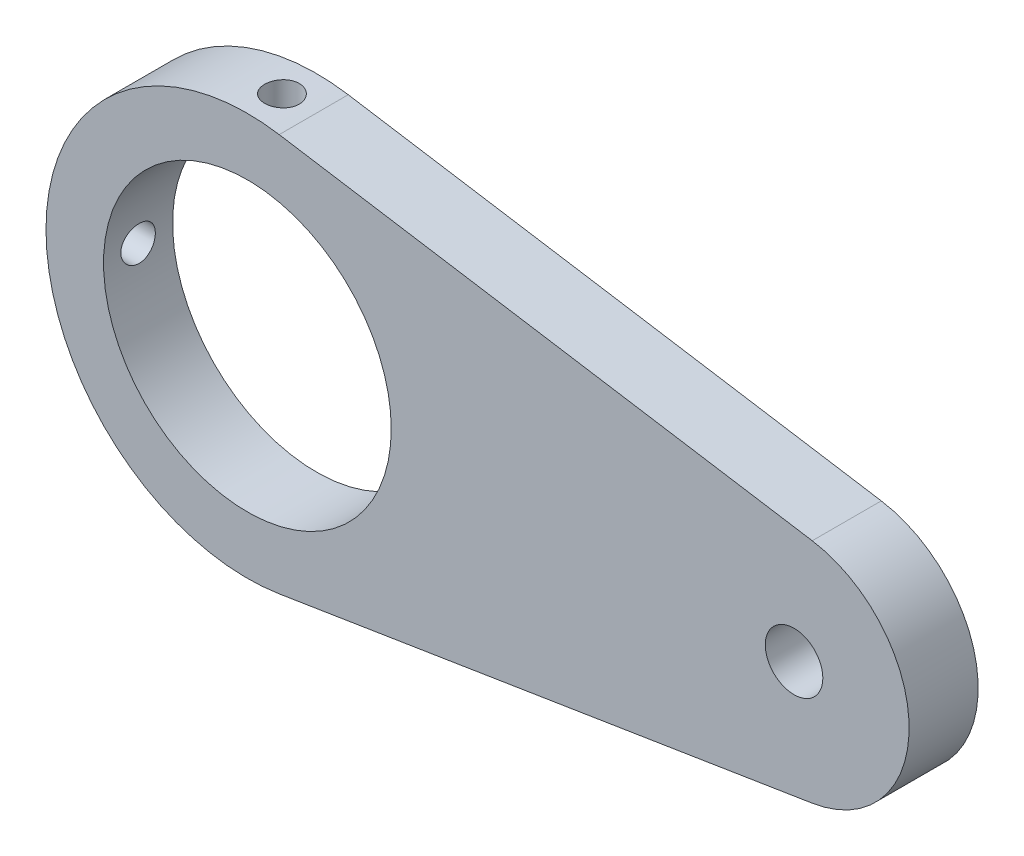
from build123d import *

# Parameters (mm, degrees)
SKETCH_1_R          = 25
SKETCH_1_R_2        = 5
EXTRUDE_1_DEPTH     = 12
SKETCH_2_R          = 3
CUT_EXTRUDE_1_DEPTH = 12
SKETCH_3_R          = 3
CUT_EXTRUDE_2_DEPTH = 16


with BuildPart() as part:
    # Sketch 1 → Extrude 1 (new body)
    with BuildSketch(Plane.XY):
        with BuildLine():
            Line((5.526315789, 34.56095823), (98.157894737, 19.749118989))
            ThreePointArc((98.157894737, 19.749118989), (115, 0), (98.157894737, -19.749118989))
            Line((98.157894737, -19.749118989), (5.526315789, -34.56095823))
            ThreePointArc((5.526315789, -34.56095823), (-35, 0), (5.526315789, 34.56095823))
        make_face()
        Circle(SKETCH_1_R, mode=Mode.SUBTRACT)
        with Locations((95, 0)):
            Circle(SKETCH_1_R_2, mode=Mode.SUBTRACT)
    extrude(amount=EXTRUDE_1_DEPTH)

    # Sketch 2 → Cut-Extrude 1 (cut)
    with BuildSketch(Plane(origin=(0, 35, 0), x_dir=(1, 0, 0), z_dir=(0, 1, 0))):
        with Locations(Location((0, -6, 0), (0, 0, 270))):
            Circle(SKETCH_2_R)
    extrude(amount=-CUT_EXTRUDE_1_DEPTH, mode=Mode.SUBTRACT)

    # Sketch 3 → Cut-Extrude 2 (cut)
    with BuildSketch(Plane(origin=(-35, 0, 0), x_dir=(0, 0, -1), z_dir=(1, 0, 0))):
        with Locations(Location((-6, 0, 0), (0, 0, 180))):
            Circle(SKETCH_3_R)
    extrude(amount=CUT_EXTRUDE_2_DEPTH, mode=Mode.SUBTRACT)


solid = part.part
